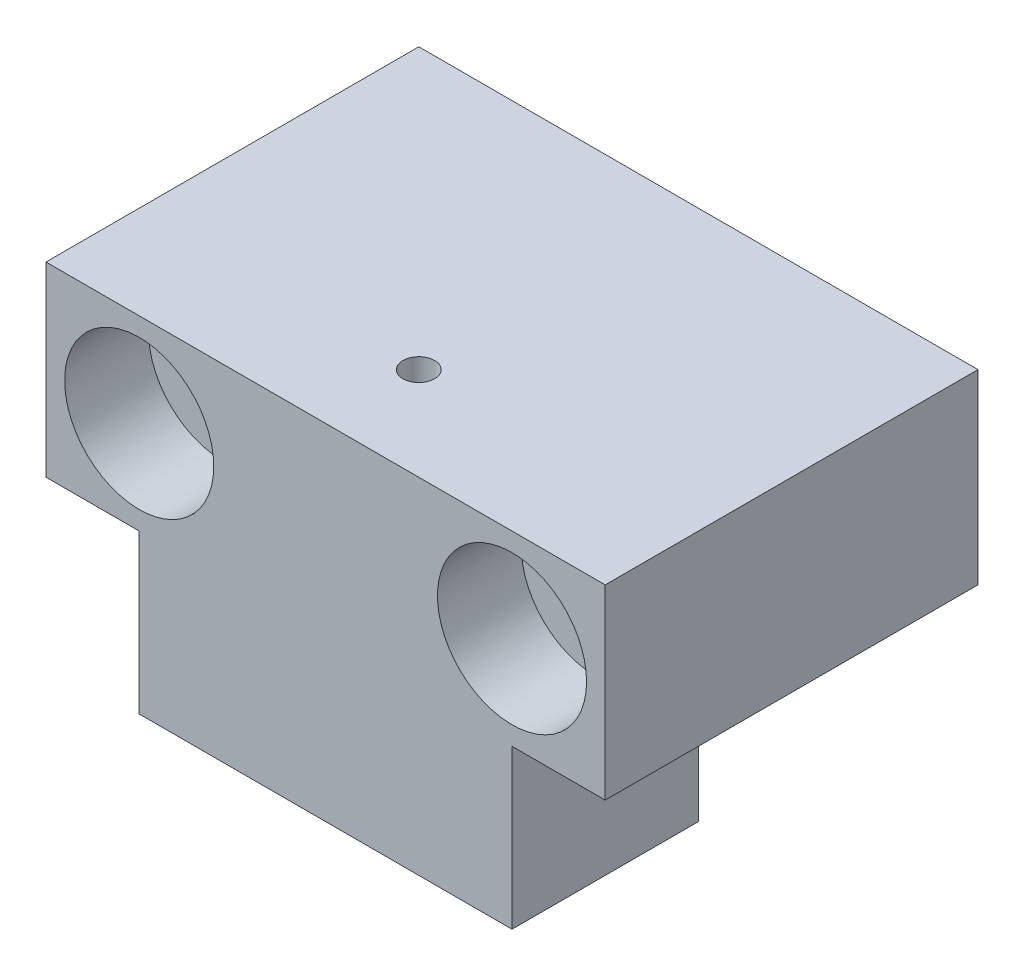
from build123d import *

# Parameters (mm, degrees)
SKETCH_1_R               = 2.25
EXTRUDE_1_DEPTH          = 20
SKETCH_2_R               = 4
CUT_EXTRUDE_1_DEPTH      = 4.5
CUT_EXTRUDE_2_DEPTH      = 41.524683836
CUT_EXTRUDE_2_DEPTH_BACK = 41.524683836
SKETCH_4_R               = 0.85
CUT_EXTRUDE_3_DEPTH      = 41.524683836


with BuildPart() as part:
    # Sketch 1 → Extrude 1 (new body)
    with BuildSketch(Plane.XY):
        Polygon((0, 8.5), (5, 8.5), (5, 0), (25, 0), (25, 8.5), (30, 8.5), (30, 18.5), (0, 18.5), align=None)
        with Locations((5, 13.5)):
            Circle(SKETCH_1_R, mode=Mode.SUBTRACT)
        with Locations((25, 13.5)):
            Circle(SKETCH_1_R, mode=Mode.SUBTRACT)
    extrude(amount=EXTRUDE_1_DEPTH)

    # Sketch 2 → Cut-Extrude 1 (cut)
    with BuildSketch(Plane.XY.offset(20)):
        with Locations((5, 13.5)):
            Circle(SKETCH_2_R)
        with Locations((25, 13.5)):
            Circle(SKETCH_2_R)
    extrude(amount=-CUT_EXTRUDE_1_DEPTH, mode=Mode.SUBTRACT)

    # Sketch 3 → Cut-Extrude 2 (cut, two sides: drawn at the far end of the back side and taken through both)
    with BuildSketch(Plane(origin=(30, 0, 0), x_dir=(0, 0, -1), z_dir=(1, 0, 0)).offset(-CUT_EXTRUDE_2_DEPTH_BACK)):
        Polygon((-10, -54.72135955), (-10, 0), (-10, 8.5), (0, 8.5), (54.72135955, 8.5), (131.196499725, -69.789601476), (66.475140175, -133.010961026), align=None)
    extrude(amount=CUT_EXTRUDE_2_DEPTH + CUT_EXTRUDE_2_DEPTH_BACK, mode=Mode.SUBTRACT)

    # Sketch 4 → Cut-Extrude 3 (cut, through all)
    with BuildSketch(Plane(origin=(0, 18.5, 0), x_dir=(1, 0, 0), z_dir=(0, 1, 0))):
        with Locations(Location((15, -15, 0), (0, 0, 270))):
            Circle(SKETCH_4_R)
    extrude(amount=-CUT_EXTRUDE_3_DEPTH, mode=Mode.SUBTRACT)


solid = part.part
